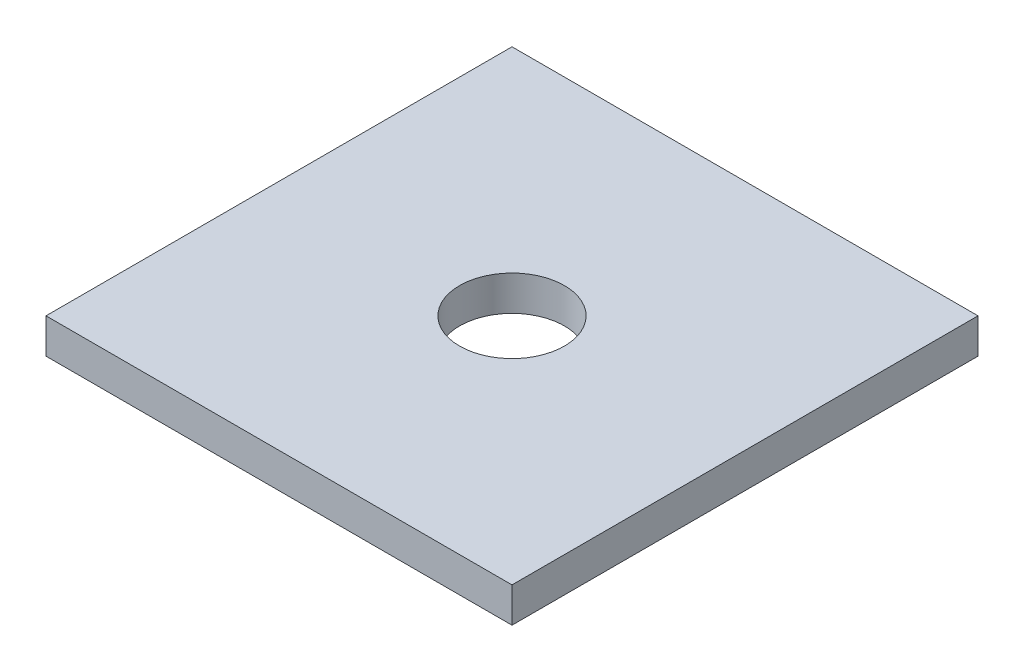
from build123d import *

# Parameters (mm, degrees)
SKETCH1_W      = 40
SKETCH1_H      = 40
SKETCH1_R      = 4.5
EXTRUDE1_DEPTH = 3


with BuildPart() as part:
    # Sketch1 → Extrude1 (new body)
    with BuildSketch(Plane(origin=(0, 0, 0), x_dir=(1, 0, 0), z_dir=(0, 1, 0))):
        with Locations((20, 20)):
            Rectangle(SKETCH1_W, SKETCH1_H)
        with Locations(Location((20, 20, 0), (0, 0, 270))):
            Circle(SKETCH1_R, mode=Mode.SUBTRACT)
    extrude(amount=EXTRUDE1_DEPTH)


solid = part.part
